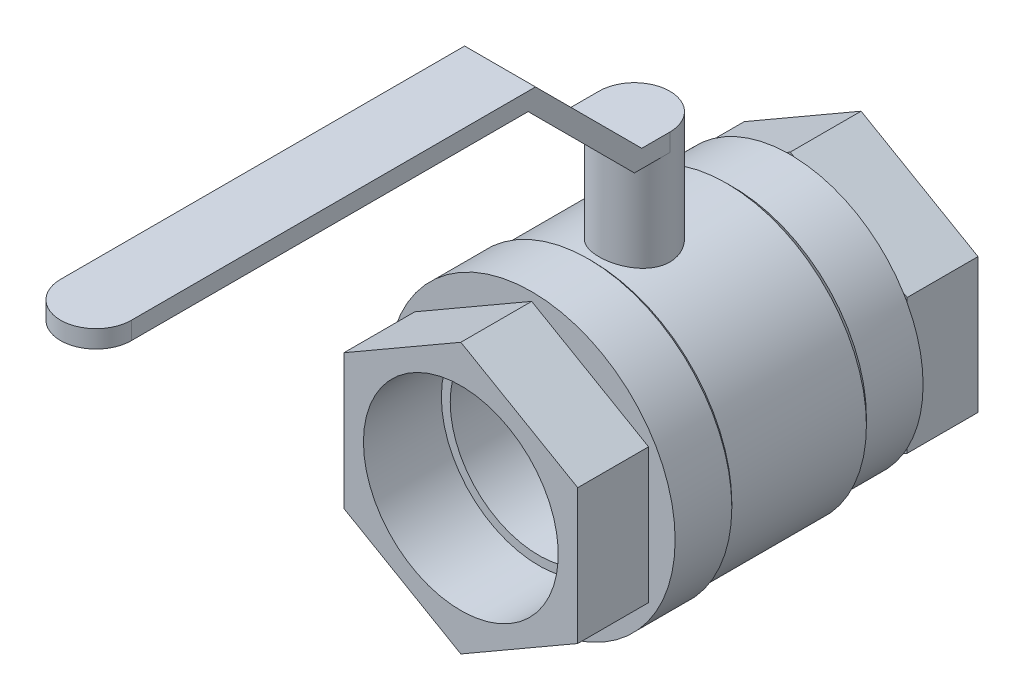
ISO-10303-21;
HEADER;
FILE_DESCRIPTION(('STEP AP214'),'2;1');
FILE_NAME('part.step','',(''),(''),'','','');
FILE_SCHEMA(('AUTOMOTIVE_DESIGN { 1 0 10303 214 1 1 1 1 }'));
ENDSEC;
DATA;
#1=APPLICATION_CONTEXT('core data for automotive mechanical design processes');
#2=APPLICATION_PROTOCOL_DEFINITION('international standard','automotive_design',2000,#1);
#3=PRODUCT_CONTEXT('',#1,'mechanical');
#4=PRODUCT('Part','Part','',(#3));
#5=PRODUCT_RELATED_PRODUCT_CATEGORY('part','',(#4));
#6=PRODUCT_DEFINITION_FORMATION('','',#4);
#7=PRODUCT_DEFINITION_CONTEXT('part definition',#1,'design');
#8=PRODUCT_DEFINITION('design','',#6,#7);
#9=PRODUCT_DEFINITION_SHAPE('','',#8);
#10=(LENGTH_UNIT() NAMED_UNIT(*) SI_UNIT(.MILLI.,.METRE.));
#11=(NAMED_UNIT(*) PLANE_ANGLE_UNIT() SI_UNIT($,.RADIAN.));
#12=(NAMED_UNIT(*) SI_UNIT($,.STERADIAN.) SOLID_ANGLE_UNIT());
#13=UNCERTAINTY_MEASURE_WITH_UNIT(LENGTH_MEASURE(1.E-05),#10,'distance_accuracy_value','');
#14=(GEOMETRIC_REPRESENTATION_CONTEXT(3) GLOBAL_UNCERTAINTY_ASSIGNED_CONTEXT((#13)) GLOBAL_UNIT_ASSIGNED_CONTEXT((#10,
#11,#12)) REPRESENTATION_CONTEXT('',''));
#15=CARTESIAN_POINT('',(0.,0.,0.));
#16=DIRECTION('',(0.,0.,1.));
#17=DIRECTION('',(1.,0.,0.));
#18=AXIS2_PLACEMENT_3D('',#15,#16,#17);
#19=CARTESIAN_POINT('',(0.,70.,-49.));
#20=DIRECTION('',(0.,1.,0.));
#21=DIRECTION('',(0.,0.,1.));
#22=AXIS2_PLACEMENT_3D('',#19,#20,#21);
#23=PLANE('',#22);
#24=CARTESIAN_POINT('',(0.,70.,-49.));
#25=DIRECTION('',(0.,1.,0.));
#26=DIRECTION('',(0.,0.,1.));
#27=AXIS2_PLACEMENT_3D('',#24,#25,#26);
#28=CIRCLE('',#27,10.);
#29=CARTESIAN_POINT('',(10.,70.,-49.));
#30=VERTEX_POINT('',#29);
#31=CARTESIAN_POINT('',(-10.,70.,-49.));
#32=VERTEX_POINT('',#31);
#33=EDGE_CURVE('E278',#30,#32,#28,.T.);
#34=ORIENTED_EDGE('',*,*,#33,.T.);
#35=DIRECTION('',(0.,0.,1.));
#36=VECTOR('',#35,1.);
#37=CARTESIAN_POINT('',(-10.,70.,-49.));
#38=LINE('',#37,#36);
#39=CARTESIAN_POINT('',(-10.,70.,-41.0710678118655));
#40=VERTEX_POINT('',#39);
#41=EDGE_CURVE('E240',#32,#40,#38,.T.);
#42=ORIENTED_EDGE('',*,*,#41,.T.);
#43=DIRECTION('',(1.,0.,0.));
#44=VECTOR('',#43,1.);
#45=CARTESIAN_POINT('',(0.,70.,-41.0710678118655));
#46=LINE('',#45,#44);
#47=CARTESIAN_POINT('',(10.,70.,-41.0710678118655));
#48=VERTEX_POINT('',#47);
#49=EDGE_CURVE('E422',#40,#48,#46,.T.);
#50=ORIENTED_EDGE('',*,*,#49,.T.);
#51=DIRECTION('',(0.,0.,1.));
#52=VECTOR('',#51,1.);
#53=CARTESIAN_POINT('',(10.,70.,-49.));
#54=LINE('',#53,#52);
#55=EDGE_CURVE('E252',#30,#48,#54,.T.);
#56=ORIENTED_EDGE('',*,*,#55,.F.);
#57=EDGE_LOOP('',(#34,#42,#50,#56));
#58=FACE_BOUND('',#57,.T.);
#59=ADVANCED_FACE('F38',(#58),#23,.T.);
#60=CARTESIAN_POINT('',(0.,0.,-108.));
#61=DIRECTION('',(0.,0.,-1.));
#62=DIRECTION('',(-1.,0.,0.));
#63=AXIS2_PLACEMENT_3D('',#60,#61,#62);
#64=CYLINDRICAL_SURFACE('',#63,39.5);
#65=CARTESIAN_POINT('',(0.,0.,-37.));
#66=DIRECTION('',(0.,0.,-1.));
#67=DIRECTION('',(-1.,0.,0.));
#68=AXIS2_PLACEMENT_3D('',#65,#66,#67);
#69=CIRCLE('',#68,39.5);
#70=CARTESIAN_POINT('',(-39.5,0.,-37.));
#71=VERTEX_POINT('',#70);
#72=EDGE_CURVE('E405',#71,#71,#69,.T.);
#73=ORIENTED_EDGE('',*,*,#72,.T.);
#74=EDGE_LOOP('',(#73));
#75=FACE_BOUND('',#74,.T.);
#76=CARTESIAN_POINT('',(0.,0.,-75.));
#77=DIRECTION('',(0.,0.,-1.));
#78=DIRECTION('',(-1.,0.,0.));
#79=AXIS2_PLACEMENT_3D('',#76,#77,#78);
#80=CIRCLE('',#79,39.5);
#81=CARTESIAN_POINT('',(-39.5,0.,-75.));
#82=VERTEX_POINT('',#81);
#83=EDGE_CURVE('E402',#82,#82,#80,.T.);
#84=ORIENTED_EDGE('',*,*,#83,.F.);
#85=EDGE_LOOP('',(#84));
#86=FACE_BOUND('',#85,.T.);
#87=CARTESIAN_POINT('',(0.,39.5,-59.));
#88=CARTESIAN_POINT('',(-0.276161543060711,39.4999993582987,-58.9999988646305));
#89=CARTESIAN_POINT('',(-0.552345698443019,39.4970966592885,-58.9885505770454));
#90=CARTESIAN_POINT('',(-1.10271739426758,39.4855645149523,-58.9428509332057));
#91=CARTESIAN_POINT('',(-1.37690471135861,39.4769344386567,-58.9085970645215));
#92=CARTESIAN_POINT('',(-1.9214138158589,39.4541817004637,-58.8175554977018));
#93=CARTESIAN_POINT('',(-2.19173372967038,39.4400564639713,-58.7607572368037));
#94=CARTESIAN_POINT('',(-2.7264592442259,39.4067023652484,-58.6250978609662));
#95=CARTESIAN_POINT('',(-2.99086470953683,39.3874733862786,-58.5462362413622));
#96=CARTESIAN_POINT('',(-3.51159747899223,39.3444641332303,-58.3671977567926));
#97=CARTESIAN_POINT('',(-3.76793451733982,39.3206896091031,-58.2670478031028));
#98=CARTESIAN_POINT('',(-4.27115825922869,39.2692142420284,-58.0461438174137));
#99=CARTESIAN_POINT('',(-4.51804491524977,39.2415133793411,-57.925389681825));
#100=CARTESIAN_POINT('',(-5.00071632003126,39.1829291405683,-57.6641863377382));
#101=CARTESIAN_POINT('',(-5.23650290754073,39.1520462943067,-57.5237404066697));
#102=CARTESIAN_POINT('',(-5.69559904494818,39.0878996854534,-57.2240698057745));
#103=CARTESIAN_POINT('',(-5.91890408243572,39.0546350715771,-57.064838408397));
#104=CARTESIAN_POINT('',(-6.35555981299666,38.9859796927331,-56.725587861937));
#105=CARTESIAN_POINT('',(-6.56864935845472,38.9505609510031,-56.545238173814));
#106=CARTESIAN_POINT('',(-6.97905330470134,38.8791233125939,-56.1673330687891));
#107=CARTESIAN_POINT('',(-7.17636046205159,38.8431041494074,-55.9697698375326));
#108=CARTESIAN_POINT('',(-7.55382669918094,38.7714665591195,-55.558777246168));
#109=CARTESIAN_POINT('',(-7.73398376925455,38.7358481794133,-55.345346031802));
#110=CARTESIAN_POINT('',(-8.07584116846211,38.6660215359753,-54.9041207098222));
#111=CARTESIAN_POINT('',(-8.23754978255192,38.6318126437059,-54.6763331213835));
#112=CARTESIAN_POINT('',(-8.5438819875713,38.5652310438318,-54.2040881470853));
#113=CARTESIAN_POINT('',(-8.68819623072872,38.5328957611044,-53.9594246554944));
#114=CARTESIAN_POINT('',(-8.95559180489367,38.471628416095,-53.4584702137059));
#115=CARTESIAN_POINT('',(-9.0786814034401,38.4426950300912,-53.2021838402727));
#116=CARTESIAN_POINT('',(-9.30273773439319,38.3890915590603,-52.6796579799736));
#117=CARTESIAN_POINT('',(-9.4037028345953,38.364421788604,-52.4134177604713));
#118=CARTESIAN_POINT('',(-9.58266025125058,38.3201139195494,-51.8729179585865));
#119=CARTESIAN_POINT('',(-9.66065313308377,38.3004756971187,-51.5986585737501));
#120=CARTESIAN_POINT('',(-9.79163453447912,38.267197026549,-51.049839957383));
#121=CARTESIAN_POINT('',(-9.84510298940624,38.2534418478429,-50.7754021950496));
#122=CARTESIAN_POINT('',(-9.92889175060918,38.23177980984,-50.222785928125));
#123=CARTESIAN_POINT('',(-9.95921234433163,38.2238728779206,-49.9446074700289));
#124=CARTESIAN_POINT('',(-9.9964341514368,38.2141554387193,-49.3866223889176));
#125=CARTESIAN_POINT('',(-10.0033387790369,38.2123440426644,-49.1068160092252));
#126=CARTESIAN_POINT('',(-9.99367596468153,38.2148723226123,-48.5476390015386));
#127=CARTESIAN_POINT('',(-9.97710885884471,38.219211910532,-48.2682683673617));
#128=CARTESIAN_POINT('',(-9.9213574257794,38.2337215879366,-47.7190001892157));
#129=CARTESIAN_POINT('',(-9.8827475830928,38.2437435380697,-47.4490401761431));
#130=CARTESIAN_POINT('',(-9.78367934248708,38.2692073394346,-46.9134260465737));
#131=CARTESIAN_POINT('',(-9.72322136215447,38.2846490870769,-46.6477718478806));
#132=CARTESIAN_POINT('',(-9.58095648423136,38.3204990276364,-46.1226280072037));
#133=CARTESIAN_POINT('',(-9.49915235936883,38.3409065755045,-45.8631375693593));
#134=CARTESIAN_POINT('',(-9.31479498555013,38.3861120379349,-45.3519243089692));
#135=CARTESIAN_POINT('',(-9.21223395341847,38.4109115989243,-45.1002044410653));
#136=CARTESIAN_POINT('',(-8.9860075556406,38.4644681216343,-44.6037716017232));
#137=CARTESIAN_POINT('',(-8.86213958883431,38.4932625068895,-44.3591550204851));
#138=CARTESIAN_POINT('',(-8.59492055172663,38.5538078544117,-43.8811804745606));
#139=CARTESIAN_POINT('',(-8.45156859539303,38.5855589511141,-43.647823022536));
#140=CARTESIAN_POINT('',(-8.14635192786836,38.6511488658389,-43.1938153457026));
#141=CARTESIAN_POINT('',(-7.9844848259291,38.6849879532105,-42.9731667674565));
#142=CARTESIAN_POINT('',(-7.64331925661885,38.753837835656,-42.5459783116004));
#143=CARTESIAN_POINT('',(-7.46402046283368,38.788848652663,-42.3394386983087));
#144=CARTESIAN_POINT('',(-7.08363556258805,38.860141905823,-41.9359203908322));
#145=CARTESIAN_POINT('',(-6.88206481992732,38.8964315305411,-41.7393995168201));
#146=CARTESIAN_POINT('',(-6.46300680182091,38.9682527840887,-41.3639880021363));
#147=CARTESIAN_POINT('',(-6.24551978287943,39.0037844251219,-41.185097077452));
#148=CARTESIAN_POINT('',(-5.79599899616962,39.0731124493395,-40.8461263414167));
#149=CARTESIAN_POINT('',(-5.56396160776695,39.1069083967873,-40.6860512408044));
#150=CARTESIAN_POINT('',(-5.08702096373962,39.1718024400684,-40.385966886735));
#151=CARTESIAN_POINT('',(-4.84212273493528,39.2029015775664,-40.2459498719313));
#152=CARTESIAN_POINT('',(-4.34007233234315,39.261659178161,-39.9864589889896));
#153=CARTESIAN_POINT('',(-4.08287691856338,39.2893040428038,-39.8670656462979));
#154=CARTESIAN_POINT('',(-3.55889875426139,39.3402277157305,-39.6504219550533));
#155=CARTESIAN_POINT('',(-3.29211594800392,39.3635064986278,-39.5531717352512));
#156=CARTESIAN_POINT('',(-2.7509280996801,39.405025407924,-39.3816343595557));
#157=CARTESIAN_POINT('',(-2.47652428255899,39.4232663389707,-39.3073435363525));
#158=CARTESIAN_POINT('',(-1.92208982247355,39.4541841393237,-39.1823465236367));
#159=CARTESIAN_POINT('',(-1.64205932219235,39.4668611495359,-39.1316397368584));
#160=CARTESIAN_POINT('',(-1.08588647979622,39.4860258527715,-39.0552745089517));
#161=CARTESIAN_POINT('',(-0.809834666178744,39.4926670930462,-39.0289942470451));
#162=CARTESIAN_POINT('',(-0.256425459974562,39.5001369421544,-38.9994487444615));
#163=CARTESIAN_POINT('',(0.0209319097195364,39.5009656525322,-38.9961831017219));
#164=CARTESIAN_POINT('',(0.574890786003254,39.4967874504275,-39.0126939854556));
#165=CARTESIAN_POINT('',(0.851492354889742,39.4917810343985,-39.0324685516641));
#166=CARTESIAN_POINT('',(1.4019378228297,39.4760735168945,-39.0948856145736));
#167=CARTESIAN_POINT('',(1.67578173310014,39.4653724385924,-39.1375280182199));
#168=CARTESIAN_POINT('',(2.2145776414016,39.4387790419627,-39.244492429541));
#169=CARTESIAN_POINT('',(2.47960157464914,39.422968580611,-39.3084730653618));
#170=CARTESIAN_POINT('',(3.00323400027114,39.3865391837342,-39.4577411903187));
#171=CARTESIAN_POINT('',(3.26184257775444,39.3659203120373,-39.5430283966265));
#172=CARTESIAN_POINT('',(3.77089144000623,39.3204231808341,-39.7342407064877));
#173=CARTESIAN_POINT('',(4.02133256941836,39.2955453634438,-39.8401636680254));
#174=CARTESIAN_POINT('',(4.51253964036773,39.2421718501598,-40.0719114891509));
#175=CARTESIAN_POINT('',(4.75330191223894,39.2136747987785,-40.1977438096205));
#176=CARTESIAN_POINT('',(5.22774004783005,39.1532749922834,-40.4708158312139));
#177=CARTESIAN_POINT('',(5.46121206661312,39.1213204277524,-40.6183982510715));
#178=CARTESIAN_POINT('',(5.91496355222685,39.0552913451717,-40.9322057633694));
#179=CARTESIAN_POINT('',(6.13524244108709,39.0212167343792,-41.0984316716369));
#180=CARTESIAN_POINT('',(6.56123429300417,38.9518521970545,-41.4484301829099));
#181=CARTESIAN_POINT('',(6.76694523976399,38.9165621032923,-41.6322052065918));
#182=CARTESIAN_POINT('',(7.16246769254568,38.8457131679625,-42.0160891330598));
#183=CARTESIAN_POINT('',(7.35227898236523,38.8101543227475,-42.2161982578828));
#184=CARTESIAN_POINT('',(7.71936922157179,38.7388330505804,-42.636731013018));
#185=CARTESIAN_POINT('',(7.89621013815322,38.7030881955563,-42.8575402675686));
#186=CARTESIAN_POINT('',(8.2306672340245,38.6333445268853,-43.3135195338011));
#187=CARTESIAN_POINT('',(8.38828390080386,38.599345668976,-43.5486891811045));
#188=CARTESIAN_POINT('',(8.68319270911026,38.5340756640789,-44.0318729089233));
#189=CARTESIAN_POINT('',(8.82048091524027,38.5028050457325,-44.2798894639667));
#190=CARTESIAN_POINT('',(9.07360709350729,38.4439402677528,-44.7869356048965));
#191=CARTESIAN_POINT('',(9.18945366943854,38.4163446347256,-45.0459607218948));
#192=CARTESIAN_POINT('',(9.39823540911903,38.3658005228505,-45.5717755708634));
#193=CARTESIAN_POINT('',(9.49129952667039,38.3428260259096,-45.8385115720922));
#194=CARTESIAN_POINT('',(9.65461226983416,38.3020306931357,-46.3792690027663));
#195=CARTESIAN_POINT('',(9.72486092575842,38.2842098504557,-46.6532904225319));
#196=CARTESIAN_POINT('',(9.84192413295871,38.2542832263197,-47.2065498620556));
#197=CARTESIAN_POINT('',(9.88874311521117,38.2421763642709,-47.4857868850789));
#198=CARTESIAN_POINT('',(9.95854696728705,38.2240585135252,-48.0474183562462));
#199=CARTESIAN_POINT('',(9.98153242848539,38.2180473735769,-48.3298127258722));
#200=CARTESIAN_POINT('',(10.0031383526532,38.2123977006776,-48.8872420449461));
#201=CARTESIAN_POINT('',(10.002457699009,38.212576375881,-49.1622482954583));
#202=CARTESIAN_POINT('',(9.97846043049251,38.2188498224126,-49.7111993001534));
#203=CARTESIAN_POINT('',(9.95514428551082,38.224944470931,-49.985144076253));
#204=CARTESIAN_POINT('',(9.88607794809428,38.2428650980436,-50.5299901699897));
#205=CARTESIAN_POINT('',(9.84032837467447,38.254690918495,-50.800891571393));
#206=CARTESIAN_POINT('',(9.7267803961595,38.2837194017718,-51.3377379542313));
#207=CARTESIAN_POINT('',(9.658981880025,38.3009220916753,-51.6036829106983));
#208=CARTESIAN_POINT('',(9.50239822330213,38.3400689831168,-52.1270688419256));
#209=CARTESIAN_POINT('',(9.41375195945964,38.3619817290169,-52.3845537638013));
#210=CARTESIAN_POINT('',(9.21588821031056,38.4099956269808,-52.8911941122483));
#211=CARTESIAN_POINT('',(9.10666329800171,38.4360982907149,-53.1403464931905));
#212=CARTESIAN_POINT('',(8.86847587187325,38.4917534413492,-53.6285971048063));
#213=CARTESIAN_POINT('',(8.73951510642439,38.5213056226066,-53.8676962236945));
#214=CARTESIAN_POINT('',(8.46274480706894,38.5830538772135,-54.3343748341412));
#215=CARTESIAN_POINT('',(8.31493435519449,38.6152500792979,-54.5619537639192));
#216=CARTESIAN_POINT('',(7.99726359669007,38.6823062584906,-55.0100923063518));
#217=CARTESIAN_POINT('',(7.8269198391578,38.7172144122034,-55.2303021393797));
#218=CARTESIAN_POINT('',(7.46855354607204,38.7879369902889,-55.6556783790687));
#219=CARTESIAN_POINT('',(7.28053072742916,38.8237514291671,-55.8608445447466));
#220=CARTESIAN_POINT('',(6.88799150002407,38.8953130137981,-56.2548551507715));
#221=CARTESIAN_POINT('',(6.68347111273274,38.9310601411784,-56.4436956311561));
#222=CARTESIAN_POINT('',(6.25930183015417,39.0015044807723,-56.8037509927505));
#223=CARTESIAN_POINT('',(6.03965325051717,39.0362017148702,-56.9749662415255));
#224=CARTESIAN_POINT('',(5.5823391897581,39.10424434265,-57.3016832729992));
#225=CARTESIAN_POINT('',(5.34441114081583,39.1375516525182,-57.4568257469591));
#226=CARTESIAN_POINT('',(4.85600767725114,39.2011454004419,-57.7464139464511));
#227=CARTESIAN_POINT('',(4.60553690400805,39.2314329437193,-57.8808672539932));
#228=CARTESIAN_POINT('',(4.09380764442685,39.2881277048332,-58.1280584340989));
#229=CARTESIAN_POINT('',(3.832553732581,39.3145365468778,-58.2408054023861));
#230=CARTESIAN_POINT('',(3.301033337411,39.3627278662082,-58.4437319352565));
#231=CARTESIAN_POINT('',(3.03076819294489,39.3845110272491,-58.5339148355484));
#232=CARTESIAN_POINT('',(2.53356245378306,39.4193007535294,-58.676523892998));
#233=CARTESIAN_POINT('',(2.30779068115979,39.4331845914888,-58.7328432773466));
#234=CARTESIAN_POINT('',(1.85268265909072,39.4571852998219,-58.8296325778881));
#235=CARTESIAN_POINT('',(1.62334665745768,39.4673024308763,-58.8701035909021));
#236=CARTESIAN_POINT('',(1.16224813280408,39.4835712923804,-58.9349579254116));
#237=CARTESIAN_POINT('',(0.930485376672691,39.4897226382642,-58.9593396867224));
#238=CARTESIAN_POINT('',(0.465820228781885,39.4979367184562,-58.9918590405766));
#239=CARTESIAN_POINT('',(0.232918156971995,39.5000005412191,-59.0000009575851));
#240=CARTESIAN_POINT('',(0.,39.5,-59.));
#241=B_SPLINE_CURVE_WITH_KNOTS('',3,(#87,#88,#89,#90,#91,#92,#93,#94,#95,#96,#97,#98,#99,#100,
#101,#102,#103,#104,#105,#106,#107,#108,#109,#110,#111,#112,#113,#114,#115,#116,#117,#118,#119,
#120,#121,#122,#123,#124,#125,#126,#127,#128,#129,#130,#131,#132,#133,#134,#135,#136,#137,#138,
#139,#140,#141,#142,#143,#144,#145,#146,#147,#148,#149,#150,#151,#152,#153,#154,#155,#156,#157,
#158,#159,#160,#161,#162,#163,#164,#165,#166,#167,#168,#169,#170,#171,#172,#173,#174,#175,#176,
#177,#178,#179,#180,#181,#182,#183,#184,#185,#186,#187,#188,#189,#190,#191,#192,#193,#194,#195,
#196,#197,#198,#199,#200,#201,#202,#203,#204,#205,#206,#207,#208,#209,#210,#211,#212,#213,#214,
#215,#216,#217,#218,#219,#220,#221,#222,#223,#224,#225,#226,#227,#228,#229,#230,#231,#232,#233,
#234,#235,#236,#237,#238,#239,#240),.UNSPECIFIED.,.T.,.F.,(4,2,2,2,2,2,2,2,2,2,2,2,2,2,2,2,2,2,
2,2,2,2,2,2,2,2,2,2,2,2,2,2,2,2,2,2,2,2,2,2,2,2,2,2,2,2,2,2,2,2,2,2,2,2,2,2,2,2,2,2,2,2,2,2,2,2,
2,2,2,2,2,2,2,2,2,2,4),(0.,0.828272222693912,1.65663570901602,2.4853877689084,3.31415878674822,
4.14188829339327,4.96962196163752,5.79721802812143,6.62511138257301,7.46834648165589,
8.31196639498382,9.15568504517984,9.99902328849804,10.8556496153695,11.7119415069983,
12.5682965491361,13.4246305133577,14.2634048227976,15.1021687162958,15.9408103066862,
16.7794398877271,17.5971502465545,18.4148449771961,19.2324335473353,20.0503292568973,
20.8764818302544,21.702671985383,22.528968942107,23.3552813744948,24.205818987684,
25.0563428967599,25.9070792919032,26.7574856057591,27.611140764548,28.4648008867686,
29.3183245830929,30.1718266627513,31.0029532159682,31.8340652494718,32.6651065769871,
33.4961445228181,34.3144787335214,35.1328020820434,35.9510405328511,36.7695863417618,
37.6027765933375,38.4360033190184,39.269345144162,40.1026982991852,40.9571152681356,
41.8115105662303,42.666071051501,43.5202878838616,44.3695516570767,45.2188143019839,
46.0679162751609,46.9169971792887,47.7410258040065,48.5650373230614,49.3890261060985,
50.2130190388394,51.0316711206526,51.8506192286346,52.6694948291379,53.4884103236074,
54.32919620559,55.1699955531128,56.0109982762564,56.8519834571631,57.7089073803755,
58.5655165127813,59.4217659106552,60.2778886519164,60.9766306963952,61.6753243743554,
62.3740857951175,63.0726611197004),.UNSPECIFIED.);
#242=CARTESIAN_POINT('',(0.,39.5,-59.));
#243=VERTEX_POINT('',#242);
#244=EDGE_CURVE('E414',#243,#243,#241,.T.);
#245=ORIENTED_EDGE('',*,*,#244,.F.);
#246=EDGE_LOOP('',(#245));
#247=FACE_BOUND('',#246,.T.);
#248=ADVANCED_FACE('F423',(#75,#86,#247),#64,.T.);
#249=CARTESIAN_POINT('',(37.5,0.,-93.));
#250=DIRECTION('',(0.,0.,-1.));
#251=DIRECTION('',(-1.,0.,0.));
#252=AXIS2_PLACEMENT_3D('',#249,#250,#251);
#253=PLANE('',#252);
#254=DIRECTION('',(0.866025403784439,0.5,0.));
#255=VECTOR('',#254,1.);
#256=CARTESIAN_POINT('',(33.,-19.0525588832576,-93.));
#257=LINE('',#256,#255);
#258=CARTESIAN_POINT('',(0.,-38.1051177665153,-93.));
#259=VERTEX_POINT('',#258);
#260=CARTESIAN_POINT('',(1.07477714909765,-37.4845948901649,-93.));
#261=VERTEX_POINT('',#260);
#262=EDGE_CURVE('E338',#259,#261,#257,.T.);
#263=ORIENTED_EDGE('',*,*,#262,.T.);
#264=CARTESIAN_POINT('',(0.,0.,-93.));
#265=DIRECTION('',(0.,0.,-1.));
#266=DIRECTION('',(-1.,0.,0.));
#267=AXIS2_PLACEMENT_3D('',#264,#265,#266);
#268=CIRCLE('',#267,37.5);
#269=CARTESIAN_POINT('',(-1.07477714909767,-37.4845948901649,-93.));
#270=VERTEX_POINT('',#269);
#271=EDGE_CURVE('E934',#261,#270,#268,.T.);
#272=ORIENTED_EDGE('',*,*,#271,.T.);
#273=DIRECTION('',(0.866025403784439,-0.5,0.));
#274=VECTOR('',#273,1.);
#275=CARTESIAN_POINT('',(0.,-38.1051177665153,-93.));
#276=LINE('',#275,#274);
#277=EDGE_CURVE('E287',#270,#259,#276,.T.);
#278=ORIENTED_EDGE('',*,*,#277,.T.);
#279=EDGE_LOOP('',(#263,#272,#278));
#280=FACE_BOUND('',#279,.T.);
#281=ADVANCED_FACE('F493',(#280),#253,.F.);
#282=CARTESIAN_POINT('',(-33.,-19.0525588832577,-93.));
#283=VERTEX_POINT('',#282);
#284=CARTESIAN_POINT('',(-31.9252228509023,-19.6730817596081,-93.));
#285=VERTEX_POINT('',#284);
#286=EDGE_CURVE('E282',#283,#285,#276,.T.);
#287=ORIENTED_EDGE('',*,*,#286,.T.);
#288=CARTESIAN_POINT('',(-33.,-17.8115131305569,-93.));
#289=VERTEX_POINT('',#288);
#290=EDGE_CURVE('E384',#285,#289,#268,.T.);
#291=ORIENTED_EDGE('',*,*,#290,.T.);
#292=DIRECTION('',(0.,-1.,0.));
#293=VECTOR('',#292,1.);
#294=CARTESIAN_POINT('',(-33.,-19.0525588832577,-93.));
#295=LINE('',#294,#293);
#296=EDGE_CURVE('E292',#289,#283,#295,.T.);
#297=ORIENTED_EDGE('',*,*,#296,.T.);
#298=EDGE_LOOP('',(#287,#291,#297));
#299=FACE_BOUND('',#298,.T.);
#300=ADVANCED_FACE('F496',(#299),#253,.F.);
#301=CARTESIAN_POINT('',(-33.,19.0525588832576,-93.));
#302=VERTEX_POINT('',#301);
#303=CARTESIAN_POINT('',(-33.,17.8115131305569,-93.));
#304=VERTEX_POINT('',#303);
#305=EDGE_CURVE('E288',#302,#304,#295,.T.);
#306=ORIENTED_EDGE('',*,*,#305,.T.);
#307=CARTESIAN_POINT('',(-31.9252228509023,19.673081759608,-93.));
#308=VERTEX_POINT('',#307);
#309=EDGE_CURVE('E395',#304,#308,#268,.T.);
#310=ORIENTED_EDGE('',*,*,#309,.T.);
#311=DIRECTION('',(-0.866025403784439,-0.5,0.));
#312=VECTOR('',#311,1.);
#313=CARTESIAN_POINT('',(-33.,19.0525588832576,-93.));
#314=LINE('',#313,#312);
#315=EDGE_CURVE('E297',#308,#302,#314,.T.);
#316=ORIENTED_EDGE('',*,*,#315,.T.);
#317=EDGE_LOOP('',(#306,#310,#316));
#318=FACE_BOUND('',#317,.T.);
#319=ADVANCED_FACE('F773',(#318),#253,.F.);
#320=CARTESIAN_POINT('',(0.,38.1051177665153,-93.));
#321=VERTEX_POINT('',#320);
#322=CARTESIAN_POINT('',(-1.07477714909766,37.4845948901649,-93.));
#323=VERTEX_POINT('',#322);
#324=EDGE_CURVE('E293',#321,#323,#314,.T.);
#325=ORIENTED_EDGE('',*,*,#324,.T.);
#326=CARTESIAN_POINT('',(1.07477714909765,37.4845948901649,-93.));
#327=VERTEX_POINT('',#326);
#328=EDGE_CURVE('E399',#323,#327,#268,.T.);
#329=ORIENTED_EDGE('',*,*,#328,.T.);
#330=DIRECTION('',(-0.866025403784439,0.5,0.));
#331=VECTOR('',#330,1.);
#332=CARTESIAN_POINT('',(0.,38.1051177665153,-93.));
#333=LINE('',#332,#331);
#334=EDGE_CURVE('E302',#327,#321,#333,.T.);
#335=ORIENTED_EDGE('',*,*,#334,.T.);
#336=EDGE_LOOP('',(#325,#329,#335));
#337=FACE_BOUND('',#336,.T.);
#338=ADVANCED_FACE('F780',(#337),#253,.F.);
#339=CARTESIAN_POINT('',(33.,19.0525588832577,-93.));
#340=VERTEX_POINT('',#339);
#341=CARTESIAN_POINT('',(31.9252228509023,19.673081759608,-93.));
#342=VERTEX_POINT('',#341);
#343=EDGE_CURVE('E298',#340,#342,#333,.T.);
#344=ORIENTED_EDGE('',*,*,#343,.T.);
#345=CARTESIAN_POINT('',(33.,17.8115131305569,-93.));
#346=VERTEX_POINT('',#345);
#347=EDGE_CURVE('E946',#342,#346,#268,.T.);
#348=ORIENTED_EDGE('',*,*,#347,.T.);
#349=DIRECTION('',(0.,1.,0.));
#350=VECTOR('',#349,1.);
#351=CARTESIAN_POINT('',(33.,19.0525588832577,-93.));
#352=LINE('',#351,#350);
#353=EDGE_CURVE('E306',#346,#340,#352,.T.);
#354=ORIENTED_EDGE('',*,*,#353,.T.);
#355=EDGE_LOOP('',(#344,#348,#354));
#356=FACE_BOUND('',#355,.T.);
#357=ADVANCED_FACE('F787',(#356),#253,.F.);
#358=CARTESIAN_POINT('',(31.9252228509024,-19.673081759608,-93.));
#359=VERTEX_POINT('',#358);
#360=CARTESIAN_POINT('',(33.,-19.0525588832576,-93.));
#361=VERTEX_POINT('',#360);
#362=EDGE_CURVE('E327',#359,#361,#257,.T.);
#363=ORIENTED_EDGE('',*,*,#362,.T.);
#364=CARTESIAN_POINT('',(33.,-17.8115131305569,-93.));
#365=VERTEX_POINT('',#364);
#366=EDGE_CURVE('E303',#361,#365,#352,.T.);
#367=ORIENTED_EDGE('',*,*,#366,.T.);
#368=EDGE_CURVE('E922',#365,#359,#268,.T.);
#369=ORIENTED_EDGE('',*,*,#368,.T.);
#370=EDGE_LOOP('',(#363,#367,#369));
#371=FACE_BOUND('',#370,.T.);
#372=ADVANCED_FACE('F498',(#371),#253,.F.);
#373=CARTESIAN_POINT('',(40.,0.,-20.));
#374=DIRECTION('',(0.,0.,-1.));
#375=DIRECTION('',(-1.,0.,0.));
#376=AXIS2_PLACEMENT_3D('',#373,#374,#375);
#377=PLANE('',#376);
#378=CARTESIAN_POINT('',(0.,0.,-20.));
#379=DIRECTION('',(0.,0.,-1.));
#380=DIRECTION('',(-1.,0.,0.));
#381=AXIS2_PLACEMENT_3D('',#378,#379,#380);
#382=CIRCLE('',#381,40.5);
#383=CARTESIAN_POINT('',(-40.5,0.,-20.));
#384=VERTEX_POINT('',#383);
#385=EDGE_CURVE('E411',#384,#384,#382,.T.);
#386=ORIENTED_EDGE('',*,*,#385,.F.);
#387=EDGE_LOOP('',(#386));
#388=FACE_BOUND('',#387,.T.);
#389=DIRECTION('',(0.866025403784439,-0.5,0.));
#390=VECTOR('',#389,1.);
#391=CARTESIAN_POINT('',(-33.,-19.0525588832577,-20.));
#392=LINE('',#391,#390);
#393=CARTESIAN_POINT('',(-33.,-19.0525588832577,-20.));
#394=VERTEX_POINT('',#393);
#395=CARTESIAN_POINT('',(0.,-38.1051177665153,-20.));
#396=VERTEX_POINT('',#395);
#397=EDGE_CURVE('E361',#394,#396,#392,.T.);
#398=ORIENTED_EDGE('',*,*,#397,.F.);
#399=DIRECTION('',(0.,-1.,0.));
#400=VECTOR('',#399,1.);
#401=CARTESIAN_POINT('',(-33.,19.0525588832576,-20.));
#402=LINE('',#401,#400);
#403=CARTESIAN_POINT('',(-33.,19.0525588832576,-20.));
#404=VERTEX_POINT('',#403);
#405=EDGE_CURVE('E358',#404,#394,#402,.T.);
#406=ORIENTED_EDGE('',*,*,#405,.F.);
#407=DIRECTION('',(-0.866025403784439,-0.5,0.));
#408=VECTOR('',#407,1.);
#409=CARTESIAN_POINT('',(0.,38.1051177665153,-20.));
#410=LINE('',#409,#408);
#411=CARTESIAN_POINT('',(0.,38.1051177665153,-20.));
#412=VERTEX_POINT('',#411);
#413=EDGE_CURVE('E355',#412,#404,#410,.T.);
#414=ORIENTED_EDGE('',*,*,#413,.F.);
#415=DIRECTION('',(-0.866025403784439,0.5,0.));
#416=VECTOR('',#415,1.);
#417=CARTESIAN_POINT('',(33.,19.0525588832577,-20.));
#418=LINE('',#417,#416);
#419=CARTESIAN_POINT('',(33.,19.0525588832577,-20.));
#420=VERTEX_POINT('',#419);
#421=EDGE_CURVE('E352',#420,#412,#418,.T.);
#422=ORIENTED_EDGE('',*,*,#421,.F.);
#423=DIRECTION('',(0.,1.,0.));
#424=VECTOR('',#423,1.);
#425=CARTESIAN_POINT('',(33.,-19.0525588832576,-20.));
#426=LINE('',#425,#424);
#427=CARTESIAN_POINT('',(33.,-19.0525588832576,-20.));
#428=VERTEX_POINT('',#427);
#429=EDGE_CURVE('E348',#428,#420,#426,.T.);
#430=ORIENTED_EDGE('',*,*,#429,.F.);
#431=DIRECTION('',(0.866025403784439,0.5,0.));
#432=VECTOR('',#431,1.);
#433=CARTESIAN_POINT('',(0.,-38.1051177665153,-20.));
#434=LINE('',#433,#432);
#435=EDGE_CURVE('E345',#396,#428,#434,.T.);
#436=ORIENTED_EDGE('',*,*,#435,.F.);
#437=EDGE_LOOP('',(#398,#406,#414,#422,#430,#436));
#438=FACE_BOUND('',#437,.T.);
#439=ADVANCED_FACE('F800',(#388,#438),#377,.F.);
#440=CARTESIAN_POINT('',(0.,0.,-108.));
#441=DIRECTION('',(0.,0.,-1.));
#442=DIRECTION('',(-1.,0.,0.));
#443=AXIS2_PLACEMENT_3D('',#440,#441,#442);
#444=CYLINDRICAL_SURFACE('',#443,40.5);
#445=CARTESIAN_POINT('',(0.,0.,-36.));
#446=DIRECTION('',(0.,0.,-1.));
#447=DIRECTION('',(-1.,0.,0.));
#448=AXIS2_PLACEMENT_3D('',#445,#446,#447);
#449=CIRCLE('',#448,40.5);
#450=CARTESIAN_POINT('',(-40.5,0.,-36.));
#451=VERTEX_POINT('',#450);
#452=EDGE_CURVE('E408',#451,#451,#449,.T.);
#453=ORIENTED_EDGE('',*,*,#452,.F.);
#454=EDGE_LOOP('',(#453));
#455=FACE_BOUND('',#454,.T.);
#456=ORIENTED_EDGE('',*,*,#385,.T.);
#457=EDGE_LOOP('',(#456));
#458=FACE_BOUND('',#457,.T.);
#459=ADVANCED_FACE('F508',(#455,#458),#444,.T.);
#460=CARTESIAN_POINT('',(0.,0.,-36.));
#461=DIRECTION('',(0.,0.,1.));
#462=DIRECTION('',(1.,0.,0.));
#463=AXIS2_PLACEMENT_3D('',#460,#461,#462);
#464=CONICAL_SURFACE('',#463,40.5,0.785398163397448);
#465=ORIENTED_EDGE('',*,*,#72,.F.);
#466=EDGE_LOOP('',(#465));
#467=FACE_BOUND('',#466,.T.);
#468=ORIENTED_EDGE('',*,*,#452,.T.);
#469=EDGE_LOOP('',(#468));
#470=FACE_BOUND('',#469,.T.);
#471=ADVANCED_FACE('F503',(#467,#470),#464,.T.);
#472=CARTESIAN_POINT('',(0.,0.,-75.));
#473=DIRECTION('',(0.,0.,1.));
#474=DIRECTION('',(1.,0.,0.));
#475=AXIS2_PLACEMENT_3D('',#472,#473,#474);
#476=CONICAL_SURFACE('',#475,39.5,0.785398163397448);
#477=CARTESIAN_POINT('',(0.,0.,-77.));
#478=DIRECTION('',(0.,0.,-1.));
#479=DIRECTION('',(-1.,0.,0.));
#480=AXIS2_PLACEMENT_3D('',#477,#478,#479);
#481=CIRCLE('',#480,37.5);
#482=CARTESIAN_POINT('',(-37.5,0.,-77.));
#483=VERTEX_POINT('',#482);
#484=EDGE_CURVE('E398',#483,#483,#481,.T.);
#485=ORIENTED_EDGE('',*,*,#484,.F.);
#486=EDGE_LOOP('',(#485));
#487=FACE_BOUND('',#486,.T.);
#488=ORIENTED_EDGE('',*,*,#83,.T.);
#489=EDGE_LOOP('',(#488));
#490=FACE_BOUND('',#489,.T.);
#491=ADVANCED_FACE('F500',(#487,#490),#476,.T.);
#492=CARTESIAN_POINT('',(0.,0.,-108.));
#493=DIRECTION('',(0.,0.,-1.));
#494=DIRECTION('',(-1.,0.,0.));
#495=AXIS2_PLACEMENT_3D('',#492,#493,#494);
#496=CYLINDRICAL_SURFACE('',#495,37.5);
#497=ORIENTED_EDGE('',*,*,#309,.F.);
#498=CARTESIAN_POINT('',(0.,0.,-93.));
#499=DIRECTION('',(0.,0.,-1.));
#500=DIRECTION('',(-1.,0.,0.));
#501=AXIS2_PLACEMENT_3D('',#498,#499,#500);
#502=CIRCLE('',#501,37.5);
#503=EDGE_CURVE('E285',#289,#304,#502,.T.);
#504=ORIENTED_EDGE('',*,*,#503,.F.);
#505=ORIENTED_EDGE('',*,*,#290,.F.);
#506=EDGE_CURVE('E343',#270,#285,#502,.T.);
#507=ORIENTED_EDGE('',*,*,#506,.F.);
#508=ORIENTED_EDGE('',*,*,#271,.F.);
#509=EDGE_CURVE('E927',#359,#261,#502,.T.);
#510=ORIENTED_EDGE('',*,*,#509,.F.);
#511=ORIENTED_EDGE('',*,*,#368,.F.);
#512=EDGE_CURVE('E935',#346,#365,#502,.T.);
#513=ORIENTED_EDGE('',*,*,#512,.F.);
#514=ORIENTED_EDGE('',*,*,#347,.F.);
#515=EDGE_CURVE('E936',#327,#342,#502,.T.);
#516=ORIENTED_EDGE('',*,*,#515,.F.);
#517=ORIENTED_EDGE('',*,*,#328,.F.);
#518=EDGE_CURVE('E344',#308,#323,#502,.T.);
#519=ORIENTED_EDGE('',*,*,#518,.F.);
#520=EDGE_LOOP('',(#497,#504,#505,#507,#508,#510,#511,#513,#514,#516,#517,#519));
#521=FACE_BOUND('',#520,.T.);
#522=ORIENTED_EDGE('',*,*,#484,.T.);
#523=EDGE_LOOP('',(#522));
#524=FACE_BOUND('',#523,.T.);
#525=ADVANCED_FACE('F488',(#521,#524),#496,.T.);
#526=CARTESIAN_POINT('',(0.,-38.1051177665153,-20.));
#527=DIRECTION('',(0.5,-0.866025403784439,0.));
#528=DIRECTION('',(0.866025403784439,0.5,0.));
#529=AXIS2_PLACEMENT_3D('',#526,#527,#528);
#530=PLANE('',#529);
#531=DIRECTION('',(0.866025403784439,0.5,0.));
#532=VECTOR('',#531,1.);
#533=CARTESIAN_POINT('',(0.,-38.1051177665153,0.));
#534=LINE('',#533,#532);
#535=CARTESIAN_POINT('',(0.,-38.1051177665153,0.));
#536=VERTEX_POINT('',#535);
#537=CARTESIAN_POINT('',(33.,-19.0525588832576,0.));
#538=VERTEX_POINT('',#537);
#539=EDGE_CURVE('E365',#536,#538,#534,.T.);
#540=ORIENTED_EDGE('',*,*,#539,.F.);
#541=DIRECTION('',(0.,0.,1.));
#542=VECTOR('',#541,1.);
#543=CARTESIAN_POINT('',(0.,-38.1051177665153,-20.));
#544=LINE('',#543,#542);
#545=EDGE_CURVE('E382',#396,#536,#544,.T.);
#546=ORIENTED_EDGE('',*,*,#545,.F.);
#547=ORIENTED_EDGE('',*,*,#435,.T.);
#548=DIRECTION('',(0.,0.,1.));
#549=VECTOR('',#548,1.);
#550=CARTESIAN_POINT('',(33.,-19.0525588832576,-20.));
#551=LINE('',#550,#549);
#552=EDGE_CURVE('E364',#428,#538,#551,.T.);
#553=ORIENTED_EDGE('',*,*,#552,.T.);
#554=EDGE_LOOP('',(#540,#546,#547,#553));
#555=FACE_BOUND('',#554,.T.);
#556=ADVANCED_FACE('F469',(#555),#530,.T.);
#557=CARTESIAN_POINT('',(-33.,-19.0525588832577,-20.));
#558=DIRECTION('',(-0.5,-0.866025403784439,0.));
#559=DIRECTION('',(0.866025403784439,-0.5,0.));
#560=AXIS2_PLACEMENT_3D('',#557,#558,#559);
#561=PLANE('',#560);
#562=DIRECTION('',(0.866025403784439,-0.5,0.));
#563=VECTOR('',#562,1.);
#564=CARTESIAN_POINT('',(-33.,-19.0525588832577,0.));
#565=LINE('',#564,#563);
#566=CARTESIAN_POINT('',(-33.,-19.0525588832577,0.));
#567=VERTEX_POINT('',#566);
#568=EDGE_CURVE('E349',#567,#536,#565,.T.);
#569=ORIENTED_EDGE('',*,*,#568,.F.);
#570=DIRECTION('',(0.,0.,1.));
#571=VECTOR('',#570,1.);
#572=CARTESIAN_POINT('',(-33.,-19.0525588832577,-20.));
#573=LINE('',#572,#571);
#574=EDGE_CURVE('E385',#394,#567,#573,.T.);
#575=ORIENTED_EDGE('',*,*,#574,.F.);
#576=ORIENTED_EDGE('',*,*,#397,.T.);
#577=ORIENTED_EDGE('',*,*,#545,.T.);
#578=EDGE_LOOP('',(#569,#575,#576,#577));
#579=FACE_BOUND('',#578,.T.);
#580=ADVANCED_FACE('F465',(#579),#561,.T.);
#581=CARTESIAN_POINT('',(-33.,19.0525588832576,-20.));
#582=DIRECTION('',(-1.,0.,0.));
#583=DIRECTION('',(0.,0.,1.));
#584=AXIS2_PLACEMENT_3D('',#581,#582,#583);
#585=PLANE('',#584);
#586=DIRECTION('',(0.,-1.,0.));
#587=VECTOR('',#586,1.);
#588=CARTESIAN_POINT('',(-33.,19.0525588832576,0.));
#589=LINE('',#588,#587);
#590=CARTESIAN_POINT('',(-33.,19.0525588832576,0.));
#591=VERTEX_POINT('',#590);
#592=EDGE_CURVE('E377',#591,#567,#589,.T.);
#593=ORIENTED_EDGE('',*,*,#592,.F.);
#594=DIRECTION('',(0.,0.,1.));
#595=VECTOR('',#594,1.);
#596=CARTESIAN_POINT('',(-33.,19.0525588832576,-20.));
#597=LINE('',#596,#595);
#598=EDGE_CURVE('E387',#404,#591,#597,.T.);
#599=ORIENTED_EDGE('',*,*,#598,.F.);
#600=ORIENTED_EDGE('',*,*,#405,.T.);
#601=ORIENTED_EDGE('',*,*,#574,.T.);
#602=EDGE_LOOP('',(#593,#599,#600,#601));
#603=FACE_BOUND('',#602,.T.);
#604=ADVANCED_FACE('F468',(#603),#585,.T.);
#605=CARTESIAN_POINT('',(0.,38.1051177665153,-20.));
#606=DIRECTION('',(-0.5,0.866025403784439,0.));
#607=DIRECTION('',(-0.866025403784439,-0.5,0.));
#608=AXIS2_PLACEMENT_3D('',#605,#606,#607);
#609=PLANE('',#608);
#610=DIRECTION('',(-0.866025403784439,-0.5,0.));
#611=VECTOR('',#610,1.);
#612=CARTESIAN_POINT('',(0.,38.1051177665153,0.));
#613=LINE('',#612,#611);
#614=CARTESIAN_POINT('',(0.,38.1051177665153,0.));
#615=VERTEX_POINT('',#614);
#616=EDGE_CURVE('E374',#615,#591,#613,.T.);
#617=ORIENTED_EDGE('',*,*,#616,.F.);
#618=DIRECTION('',(0.,0.,1.));
#619=VECTOR('',#618,1.);
#620=CARTESIAN_POINT('',(0.,38.1051177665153,-20.));
#621=LINE('',#620,#619);
#622=EDGE_CURVE('E389',#412,#615,#621,.T.);
#623=ORIENTED_EDGE('',*,*,#622,.F.);
#624=ORIENTED_EDGE('',*,*,#413,.T.);
#625=ORIENTED_EDGE('',*,*,#598,.T.);
#626=EDGE_LOOP('',(#617,#623,#624,#625));
#627=FACE_BOUND('',#626,.T.);
#628=ADVANCED_FACE('F473',(#627),#609,.T.);
#629=CARTESIAN_POINT('',(33.,19.0525588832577,-20.));
#630=DIRECTION('',(0.5,0.866025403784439,0.));
#631=DIRECTION('',(-0.866025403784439,0.5,0.));
#632=AXIS2_PLACEMENT_3D('',#629,#630,#631);
#633=PLANE('',#632);
#634=DIRECTION('',(-0.866025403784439,0.5,0.));
#635=VECTOR('',#634,1.);
#636=CARTESIAN_POINT('',(33.,19.0525588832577,0.));
#637=LINE('',#636,#635);
#638=CARTESIAN_POINT('',(33.,19.0525588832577,0.));
#639=VERTEX_POINT('',#638);
#640=EDGE_CURVE('E371',#639,#615,#637,.T.);
#641=ORIENTED_EDGE('',*,*,#640,.F.);
#642=DIRECTION('',(0.,0.,1.));
#643=VECTOR('',#642,1.);
#644=CARTESIAN_POINT('',(33.,19.0525588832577,-20.));
#645=LINE('',#644,#643);
#646=EDGE_CURVE('E391',#420,#639,#645,.T.);
#647=ORIENTED_EDGE('',*,*,#646,.F.);
#648=ORIENTED_EDGE('',*,*,#421,.T.);
#649=ORIENTED_EDGE('',*,*,#622,.T.);
#650=EDGE_LOOP('',(#641,#647,#648,#649));
#651=FACE_BOUND('',#650,.T.);
#652=ADVANCED_FACE('F477',(#651),#633,.T.);
#653=CARTESIAN_POINT('',(33.,-19.0525588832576,-20.));
#654=DIRECTION('',(1.,0.,0.));
#655=DIRECTION('',(0.,0.,-1.));
#656=AXIS2_PLACEMENT_3D('',#653,#654,#655);
#657=PLANE('',#656);
#658=DIRECTION('',(0.,1.,0.));
#659=VECTOR('',#658,1.);
#660=CARTESIAN_POINT('',(33.,-19.0525588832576,0.));
#661=LINE('',#660,#659);
#662=EDGE_CURVE('E368',#538,#639,#661,.T.);
#663=ORIENTED_EDGE('',*,*,#662,.F.);
#664=ORIENTED_EDGE('',*,*,#552,.F.);
#665=ORIENTED_EDGE('',*,*,#429,.T.);
#666=ORIENTED_EDGE('',*,*,#646,.T.);
#667=EDGE_LOOP('',(#663,#664,#665,#666));
#668=FACE_BOUND('',#667,.T.);
#669=ADVANCED_FACE('F481',(#668),#657,.T.);
#670=CARTESIAN_POINT('',(0.,0.,0.));
#671=DIRECTION('',(0.,0.,-1.));
#672=DIRECTION('',(-1.,0.,0.));
#673=AXIS2_PLACEMENT_3D('',#670,#671,#672);
#674=PLANE('',#673);
#675=CARTESIAN_POINT('',(0.,0.,0.));
#676=DIRECTION('',(0.,0.,-1.));
#677=DIRECTION('',(-1.,0.,0.));
#678=AXIS2_PLACEMENT_3D('',#675,#676,#677);
#679=CIRCLE('',#678,27.5);
#680=CARTESIAN_POINT('',(-27.5,0.,0.));
#681=VERTEX_POINT('',#680);
#682=EDGE_CURVE('E973',#681,#681,#679,.T.);
#683=ORIENTED_EDGE('',*,*,#682,.T.);
#684=EDGE_LOOP('',(#683));
#685=FACE_BOUND('',#684,.T.);
#686=ORIENTED_EDGE('',*,*,#539,.T.);
#687=ORIENTED_EDGE('',*,*,#662,.T.);
#688=ORIENTED_EDGE('',*,*,#640,.T.);
#689=ORIENTED_EDGE('',*,*,#616,.T.);
#690=ORIENTED_EDGE('',*,*,#592,.T.);
#691=ORIENTED_EDGE('',*,*,#568,.T.);
#692=EDGE_LOOP('',(#686,#687,#688,#689,#690,#691));
#693=FACE_BOUND('',#692,.T.);
#694=ADVANCED_FACE('F40',(#685,#693),#674,.F.);
#695=CARTESIAN_POINT('',(37.5,0.,-93.));
#696=DIRECTION('',(0.,0.,-1.));
#697=DIRECTION('',(-1.,0.,0.));
#698=AXIS2_PLACEMENT_3D('',#695,#696,#697);
#699=PLANE('',#698);
#700=ORIENTED_EDGE('',*,*,#518,.T.);
#701=EDGE_CURVE('E296',#323,#308,#314,.T.);
#702=ORIENTED_EDGE('',*,*,#701,.T.);
#703=EDGE_LOOP('',(#700,#702));
#704=FACE_BOUND('',#703,.T.);
#705=ADVANCED_FACE('F436',(#704),#699,.T.);
#706=ORIENTED_EDGE('',*,*,#515,.T.);
#707=EDGE_CURVE('E301',#342,#327,#333,.T.);
#708=ORIENTED_EDGE('',*,*,#707,.T.);
#709=EDGE_LOOP('',(#706,#708));
#710=FACE_BOUND('',#709,.T.);
#711=ADVANCED_FACE('F439',(#710),#699,.T.);
#712=ORIENTED_EDGE('',*,*,#512,.T.);
#713=EDGE_CURVE('E60',#365,#346,#352,.T.);
#714=ORIENTED_EDGE('',*,*,#713,.T.);
#715=EDGE_LOOP('',(#712,#714));
#716=FACE_BOUND('',#715,.T.);
#717=ADVANCED_FACE('F665',(#716),#699,.T.);
#718=ORIENTED_EDGE('',*,*,#509,.T.);
#719=EDGE_CURVE('E341',#261,#359,#257,.T.);
#720=ORIENTED_EDGE('',*,*,#719,.T.);
#721=EDGE_LOOP('',(#718,#720));
#722=FACE_BOUND('',#721,.T.);
#723=ADVANCED_FACE('F672',(#722),#699,.T.);
#724=ORIENTED_EDGE('',*,*,#506,.T.);
#725=EDGE_CURVE('E286',#285,#270,#276,.T.);
#726=ORIENTED_EDGE('',*,*,#725,.T.);
#727=EDGE_LOOP('',(#724,#726));
#728=FACE_BOUND('',#727,.T.);
#729=ADVANCED_FACE('F679',(#728),#699,.T.);
#730=ORIENTED_EDGE('',*,*,#503,.T.);
#731=EDGE_CURVE('E291',#304,#289,#295,.T.);
#732=ORIENTED_EDGE('',*,*,#731,.T.);
#733=EDGE_LOOP('',(#730,#732));
#734=FACE_BOUND('',#733,.T.);
#735=ADVANCED_FACE('F441',(#734),#699,.T.);
#736=CARTESIAN_POINT('',(33.,-19.0525588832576,22.6968115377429));
#737=DIRECTION('',(0.5,-0.866025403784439,0.));
#738=DIRECTION('',(0.866025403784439,0.5,0.));
#739=AXIS2_PLACEMENT_3D('',#736,#737,#738);
#740=PLANE('',#739);
#741=DIRECTION('',(0.,0.,-1.));
#742=VECTOR('',#741,1.);
#743=CARTESIAN_POINT('',(0.,-38.1051177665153,22.6968115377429));
#744=LINE('',#743,#742);
#745=CARTESIAN_POINT('',(0.,-38.1051177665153,-113.));
#746=VERTEX_POINT('',#745);
#747=EDGE_CURVE('E334',#259,#746,#744,.T.);
#748=ORIENTED_EDGE('',*,*,#747,.T.);
#749=DIRECTION('',(-0.866025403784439,-0.5,0.));
#750=VECTOR('',#749,1.);
#751=CARTESIAN_POINT('',(33.,-19.0525588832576,-113.));
#752=LINE('',#751,#750);
#753=CARTESIAN_POINT('',(33.,-19.0525588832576,-113.));
#754=VERTEX_POINT('',#753);
#755=EDGE_CURVE('E309',#754,#746,#752,.T.);
#756=ORIENTED_EDGE('',*,*,#755,.F.);
#757=DIRECTION('',(0.,0.,-1.));
#758=VECTOR('',#757,1.);
#759=CARTESIAN_POINT('',(33.,-19.0525588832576,22.6968115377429));
#760=LINE('',#759,#758);
#761=EDGE_CURVE('E324',#361,#754,#760,.T.);
#762=ORIENTED_EDGE('',*,*,#761,.F.);
#763=ORIENTED_EDGE('',*,*,#362,.F.);
#764=ORIENTED_EDGE('',*,*,#719,.F.);
#765=ORIENTED_EDGE('',*,*,#262,.F.);
#766=EDGE_LOOP('',(#748,#756,#762,#763,#764,#765));
#767=FACE_BOUND('',#766,.T.);
#768=ADVANCED_FACE('F458',(#767),#740,.T.);
#769=CARTESIAN_POINT('',(0.,-38.1051177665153,22.6968115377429));
#770=DIRECTION('',(-0.5,-0.866025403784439,0.));
#771=DIRECTION('',(0.866025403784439,-0.5,0.));
#772=AXIS2_PLACEMENT_3D('',#769,#770,#771);
#773=PLANE('',#772);
#774=DIRECTION('',(0.,0.,-1.));
#775=VECTOR('',#774,1.);
#776=CARTESIAN_POINT('',(-33.,-19.0525588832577,22.6968115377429));
#777=LINE('',#776,#775);
#778=CARTESIAN_POINT('',(-33.,-19.0525588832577,-113.));
#779=VERTEX_POINT('',#778);
#780=EDGE_CURVE('E332',#283,#779,#777,.T.);
#781=ORIENTED_EDGE('',*,*,#780,.T.);
#782=DIRECTION('',(-0.866025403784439,0.5,0.));
#783=VECTOR('',#782,1.);
#784=CARTESIAN_POINT('',(0.,-38.1051177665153,-113.));
#785=LINE('',#784,#783);
#786=EDGE_CURVE('E312',#746,#779,#785,.T.);
#787=ORIENTED_EDGE('',*,*,#786,.F.);
#788=ORIENTED_EDGE('',*,*,#747,.F.);
#789=ORIENTED_EDGE('',*,*,#277,.F.);
#790=ORIENTED_EDGE('',*,*,#725,.F.);
#791=ORIENTED_EDGE('',*,*,#286,.F.);
#792=EDGE_LOOP('',(#781,#787,#788,#789,#790,#791));
#793=FACE_BOUND('',#792,.T.);
#794=ADVANCED_FACE('F454',(#793),#773,.T.);
#795=CARTESIAN_POINT('',(-33.,-19.0525588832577,22.6968115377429));
#796=DIRECTION('',(-1.,0.,0.));
#797=DIRECTION('',(0.,0.,1.));
#798=AXIS2_PLACEMENT_3D('',#795,#796,#797);
#799=PLANE('',#798);
#800=DIRECTION('',(0.,0.,-1.));
#801=VECTOR('',#800,1.);
#802=CARTESIAN_POINT('',(-33.,19.0525588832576,22.6968115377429));
#803=LINE('',#802,#801);
#804=CARTESIAN_POINT('',(-33.,19.0525588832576,-113.));
#805=VERTEX_POINT('',#804);
#806=EDGE_CURVE('E330',#302,#805,#803,.T.);
#807=ORIENTED_EDGE('',*,*,#806,.T.);
#808=DIRECTION('',(0.,1.,0.));
#809=VECTOR('',#808,1.);
#810=CARTESIAN_POINT('',(-33.,-19.0525588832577,-113.));
#811=LINE('',#810,#809);
#812=EDGE_CURVE('E315',#779,#805,#811,.T.);
#813=ORIENTED_EDGE('',*,*,#812,.F.);
#814=ORIENTED_EDGE('',*,*,#780,.F.);
#815=ORIENTED_EDGE('',*,*,#296,.F.);
#816=ORIENTED_EDGE('',*,*,#731,.F.);
#817=ORIENTED_EDGE('',*,*,#305,.F.);
#818=EDGE_LOOP('',(#807,#813,#814,#815,#816,#817));
#819=FACE_BOUND('',#818,.T.);
#820=ADVANCED_FACE('F450',(#819),#799,.T.);
#821=CARTESIAN_POINT('',(-33.,19.0525588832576,22.6968115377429));
#822=DIRECTION('',(-0.5,0.866025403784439,0.));
#823=DIRECTION('',(-0.866025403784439,-0.5,0.));
#824=AXIS2_PLACEMENT_3D('',#821,#822,#823);
#825=PLANE('',#824);
#826=DIRECTION('',(0.,0.,-1.));
#827=VECTOR('',#826,1.);
#828=CARTESIAN_POINT('',(0.,38.1051177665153,22.6968115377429));
#829=LINE('',#828,#827);
#830=CARTESIAN_POINT('',(0.,38.1051177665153,-113.));
#831=VERTEX_POINT('',#830);
#832=EDGE_CURVE('E328',#321,#831,#829,.T.);
#833=ORIENTED_EDGE('',*,*,#832,.T.);
#834=DIRECTION('',(0.866025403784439,0.5,0.));
#835=VECTOR('',#834,1.);
#836=CARTESIAN_POINT('',(-33.,19.0525588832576,-113.));
#837=LINE('',#836,#835);
#838=EDGE_CURVE('E318',#805,#831,#837,.T.);
#839=ORIENTED_EDGE('',*,*,#838,.F.);
#840=ORIENTED_EDGE('',*,*,#806,.F.);
#841=ORIENTED_EDGE('',*,*,#315,.F.);
#842=ORIENTED_EDGE('',*,*,#701,.F.);
#843=ORIENTED_EDGE('',*,*,#324,.F.);
#844=EDGE_LOOP('',(#833,#839,#840,#841,#842,#843));
#845=FACE_BOUND('',#844,.T.);
#846=ADVANCED_FACE('F446',(#845),#825,.T.);
#847=CARTESIAN_POINT('',(0.,38.1051177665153,22.6968115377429));
#848=DIRECTION('',(0.5,0.866025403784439,0.));
#849=DIRECTION('',(-0.866025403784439,0.5,0.));
#850=AXIS2_PLACEMENT_3D('',#847,#848,#849);
#851=PLANE('',#850);
#852=DIRECTION('',(0.,0.,-1.));
#853=VECTOR('',#852,1.);
#854=CARTESIAN_POINT('',(33.,19.0525588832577,22.6968115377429));
#855=LINE('',#854,#853);
#856=CARTESIAN_POINT('',(33.,19.0525588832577,-113.));
#857=VERTEX_POINT('',#856);
#858=EDGE_CURVE('E325',#340,#857,#855,.T.);
#859=ORIENTED_EDGE('',*,*,#858,.T.);
#860=DIRECTION('',(0.866025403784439,-0.5,0.));
#861=VECTOR('',#860,1.);
#862=CARTESIAN_POINT('',(0.,38.1051177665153,-113.));
#863=LINE('',#862,#861);
#864=EDGE_CURVE('E321',#831,#857,#863,.T.);
#865=ORIENTED_EDGE('',*,*,#864,.F.);
#866=ORIENTED_EDGE('',*,*,#832,.F.);
#867=ORIENTED_EDGE('',*,*,#334,.F.);
#868=ORIENTED_EDGE('',*,*,#707,.F.);
#869=ORIENTED_EDGE('',*,*,#343,.F.);
#870=EDGE_LOOP('',(#859,#865,#866,#867,#868,#869));
#871=FACE_BOUND('',#870,.T.);
#872=ADVANCED_FACE('F442',(#871),#851,.T.);
#873=CARTESIAN_POINT('',(33.,19.0525588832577,22.6968115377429));
#874=DIRECTION('',(1.,0.,0.));
#875=DIRECTION('',(0.,0.,-1.));
#876=AXIS2_PLACEMENT_3D('',#873,#874,#875);
#877=PLANE('',#876);
#878=ORIENTED_EDGE('',*,*,#761,.T.);
#879=DIRECTION('',(0.,-1.,0.));
#880=VECTOR('',#879,1.);
#881=CARTESIAN_POINT('',(33.,19.0525588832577,-113.));
#882=LINE('',#881,#880);
#883=EDGE_CURVE('E281',#857,#754,#882,.T.);
#884=ORIENTED_EDGE('',*,*,#883,.F.);
#885=ORIENTED_EDGE('',*,*,#858,.F.);
#886=ORIENTED_EDGE('',*,*,#353,.F.);
#887=ORIENTED_EDGE('',*,*,#713,.F.);
#888=ORIENTED_EDGE('',*,*,#366,.F.);
#889=EDGE_LOOP('',(#878,#884,#885,#886,#887,#888));
#890=FACE_BOUND('',#889,.T.);
#891=ADVANCED_FACE('F445',(#890),#877,.T.);
#892=CARTESIAN_POINT('',(40.,0.,-113.));
#893=DIRECTION('',(0.,0.,1.));
#894=DIRECTION('',(1.,0.,0.));
#895=AXIS2_PLACEMENT_3D('',#892,#893,#894);
#896=PLANE('',#895);
#897=CARTESIAN_POINT('',(0.,0.,-113.));
#898=DIRECTION('',(0.,0.,-1.));
#899=DIRECTION('',(-1.,0.,0.));
#900=AXIS2_PLACEMENT_3D('',#897,#898,#899);
#901=CIRCLE('',#900,27.5);
#902=CARTESIAN_POINT('',(-27.5,0.,-113.));
#903=VERTEX_POINT('',#902);
#904=EDGE_CURVE('E228',#903,#903,#901,.T.);
#905=ORIENTED_EDGE('',*,*,#904,.F.);
#906=EDGE_LOOP('',(#905));
#907=FACE_BOUND('',#906,.T.);
#908=ORIENTED_EDGE('',*,*,#755,.T.);
#909=ORIENTED_EDGE('',*,*,#786,.T.);
#910=ORIENTED_EDGE('',*,*,#812,.T.);
#911=ORIENTED_EDGE('',*,*,#838,.T.);
#912=ORIENTED_EDGE('',*,*,#864,.T.);
#913=ORIENTED_EDGE('',*,*,#883,.T.);
#914=EDGE_LOOP('',(#908,#909,#910,#911,#912,#913));
#915=FACE_BOUND('',#914,.T.);
#916=ADVANCED_FACE('F433',(#907,#915),#896,.F.);
#917=CARTESIAN_POINT('',(0.,70.,-49.));
#918=DIRECTION('',(0.,-1.,0.));
#919=DIRECTION('',(0.,0.,-1.));
#920=AXIS2_PLACEMENT_3D('',#917,#918,#919);
#921=CYLINDRICAL_SURFACE('',#920,10.);
#922=ORIENTED_EDGE('',*,*,#33,.F.);
#923=DIRECTION('',(0.,-1.,0.));
#924=VECTOR('',#923,1.);
#925=CARTESIAN_POINT('',(10.,70.,-49.));
#926=LINE('',#925,#924);
#927=CARTESIAN_POINT('',(10.,65.,-49.));
#928=VERTEX_POINT('',#927);
#929=EDGE_CURVE('E249',#30,#928,#926,.T.);
#930=ORIENTED_EDGE('',*,*,#929,.T.);
#931=CARTESIAN_POINT('',(0.,65.,-49.));
#932=DIRECTION('',(0.,-1.,0.));
#933=DIRECTION('',(0.,0.,-1.));
#934=AXIS2_PLACEMENT_3D('',#931,#932,#933);
#935=CIRCLE('',#934,10.);
#936=CARTESIAN_POINT('',(0.,65.,-39.));
#937=VERTEX_POINT('',#936);
#938=EDGE_CURVE('E46',#928,#937,#935,.T.);
#939=ORIENTED_EDGE('',*,*,#938,.T.);
#940=CARTESIAN_POINT('',(-10.,65.,-49.));
#941=VERTEX_POINT('',#940);
#942=EDGE_CURVE('E525',#937,#941,#935,.T.);
#943=ORIENTED_EDGE('',*,*,#942,.T.);
#944=DIRECTION('',(0.,-1.,0.));
#945=VECTOR('',#944,1.);
#946=CARTESIAN_POINT('',(-10.,70.,-49.));
#947=LINE('',#946,#945);
#948=EDGE_CURVE('E266',#32,#941,#947,.T.);
#949=ORIENTED_EDGE('',*,*,#948,.F.);
#950=EDGE_LOOP('',(#922,#930,#939,#943,#949));
#951=FACE_BOUND('',#950,.T.);
#952=ORIENTED_EDGE('',*,*,#244,.T.);
#953=EDGE_LOOP('',(#952));
#954=FACE_BOUND('',#953,.T.);
#955=ADVANCED_FACE('F427',(#951,#954),#921,.T.);
#956=CARTESIAN_POINT('',(10.,65.,-49.));
#957=DIRECTION('',(0.,-1.,0.));
#958=DIRECTION('',(0.,0.,-1.));
#959=AXIS2_PLACEMENT_3D('',#956,#957,#958);
#960=PLANE('',#959);
#961=ORIENTED_EDGE('',*,*,#938,.F.);
#962=DIRECTION('',(0.,0.,1.));
#963=VECTOR('',#962,1.);
#964=CARTESIAN_POINT('',(10.,65.,-49.));
#965=LINE('',#964,#963);
#966=CARTESIAN_POINT('',(10.,65.,-39.));
#967=VERTEX_POINT('',#966);
#968=EDGE_CURVE('E246',#928,#967,#965,.T.);
#969=ORIENTED_EDGE('',*,*,#968,.T.);
#970=DIRECTION('',(-1.,0.,0.));
#971=VECTOR('',#970,1.);
#972=CARTESIAN_POINT('',(10.,65.,-39.));
#973=LINE('',#972,#971);
#974=EDGE_CURVE('E273',#967,#937,#973,.T.);
#975=ORIENTED_EDGE('',*,*,#974,.T.);
#976=EDGE_LOOP('',(#961,#969,#975));
#977=FACE_BOUND('',#976,.T.);
#978=ADVANCED_FACE('F432',(#977),#960,.T.);
#979=ORIENTED_EDGE('',*,*,#942,.F.);
#980=CARTESIAN_POINT('',(-10.,65.,-39.));
#981=VERTEX_POINT('',#980);
#982=EDGE_CURVE('E272',#937,#981,#973,.T.);
#983=ORIENTED_EDGE('',*,*,#982,.T.);
#984=DIRECTION('',(0.,0.,1.));
#985=VECTOR('',#984,1.);
#986=CARTESIAN_POINT('',(-10.,65.,-49.));
#987=LINE('',#986,#985);
#988=EDGE_CURVE('E263',#941,#981,#987,.T.);
#989=ORIENTED_EDGE('',*,*,#988,.F.);
#990=EDGE_LOOP('',(#979,#983,#989));
#991=FACE_BOUND('',#990,.T.);
#992=ADVANCED_FACE('F539',(#991),#960,.T.);
#993=CARTESIAN_POINT('',(10.,100.,-9.00000000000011));
#994=DIRECTION('',(0.,-1.,0.));
#995=DIRECTION('',(0.,0.,-1.));
#996=AXIS2_PLACEMENT_3D('',#993,#994,#995);
#997=PLANE('',#996);
#998=DIRECTION('',(0.,0.,1.));
#999=VECTOR('',#998,1.);
#1000=CARTESIAN_POINT('',(-10.,100.,-9.00000000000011));
#1001=LINE('',#1000,#999);
#1002=CARTESIAN_POINT('',(-10.,100.,-11.0710678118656));
#1003=VERTEX_POINT('',#1002);
#1004=CARTESIAN_POINT('',(-10.,100.,103.));
#1005=VERTEX_POINT('',#1004);
#1006=EDGE_CURVE('E227',#1003,#1005,#1001,.T.);
#1007=ORIENTED_EDGE('',*,*,#1006,.T.);
#1008=CARTESIAN_POINT('',(0.,100.,103.));
#1009=DIRECTION('',(0.,-1.,0.));
#1010=DIRECTION('',(-1.,0.,0.));
#1011=AXIS2_PLACEMENT_3D('',#1008,#1009,#1010);
#1012=CIRCLE('',#1011,10.);
#1013=CARTESIAN_POINT('',(10.,100.,103.));
#1014=VERTEX_POINT('',#1013);
#1015=EDGE_CURVE('E52',#1014,#1005,#1012,.T.);
#1016=ORIENTED_EDGE('',*,*,#1015,.F.);
#1017=DIRECTION('',(0.,0.,1.));
#1018=VECTOR('',#1017,1.);
#1019=CARTESIAN_POINT('',(10.,100.,-9.00000000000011));
#1020=LINE('',#1019,#1018);
#1021=CARTESIAN_POINT('',(10.,100.,-11.0710678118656));
#1022=VERTEX_POINT('',#1021);
#1023=EDGE_CURVE('E225',#1022,#1014,#1020,.T.);
#1024=ORIENTED_EDGE('',*,*,#1023,.F.);
#1025=DIRECTION('',(-1.,0.,0.));
#1026=VECTOR('',#1025,1.);
#1027=CARTESIAN_POINT('',(10.,100.,-11.0710678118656));
#1028=LINE('',#1027,#1026);
#1029=EDGE_CURVE('E255',#1022,#1003,#1028,.T.);
#1030=ORIENTED_EDGE('',*,*,#1029,.T.);
#1031=EDGE_LOOP('',(#1007,#1016,#1024,#1030));
#1032=FACE_BOUND('',#1031,.T.);
#1033=ADVANCED_FACE('F223',(#1032),#997,.F.);
#1034=CARTESIAN_POINT('',(10.,95.,-9.00000000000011));
#1035=DIRECTION('',(0.,-1.,0.));
#1036=DIRECTION('',(0.,0.,-1.));
#1037=AXIS2_PLACEMENT_3D('',#1034,#1035,#1036);
#1038=PLANE('',#1037);
#1039=CARTESIAN_POINT('',(0.,95.,103.));
#1040=DIRECTION('',(0.,-1.,0.));
#1041=DIRECTION('',(0.,0.,-1.));
#1042=AXIS2_PLACEMENT_3D('',#1039,#1040,#1041);
#1043=CIRCLE('',#1042,10.);
#1044=CARTESIAN_POINT('',(-10.,95.,103.));
#1045=VERTEX_POINT('',#1044);
#1046=CARTESIAN_POINT('',(10.,95.,103.));
#1047=VERTEX_POINT('',#1046);
#1048=EDGE_CURVE('E214',#1045,#1047,#1043,.F.);
#1049=ORIENTED_EDGE('',*,*,#1048,.F.);
#1050=DIRECTION('',(0.,0.,1.));
#1051=VECTOR('',#1050,1.);
#1052=CARTESIAN_POINT('',(-10.,95.,-9.00000000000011));
#1053=LINE('',#1052,#1051);
#1054=CARTESIAN_POINT('',(-10.,95.,-9.00000000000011));
#1055=VERTEX_POINT('',#1054);
#1056=EDGE_CURVE('E257',#1055,#1045,#1053,.T.);
#1057=ORIENTED_EDGE('',*,*,#1056,.F.);
#1058=DIRECTION('',(-1.,0.,0.));
#1059=VECTOR('',#1058,1.);
#1060=CARTESIAN_POINT('',(10.,95.,-9.00000000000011));
#1061=LINE('',#1060,#1059);
#1062=CARTESIAN_POINT('',(10.,95.,-9.00000000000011));
#1063=VERTEX_POINT('',#1062);
#1064=EDGE_CURVE('E276',#1063,#1055,#1061,.T.);
#1065=ORIENTED_EDGE('',*,*,#1064,.F.);
#1066=DIRECTION('',(0.,0.,1.));
#1067=VECTOR('',#1066,1.);
#1068=CARTESIAN_POINT('',(10.,95.,-9.00000000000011));
#1069=LINE('',#1068,#1067);
#1070=EDGE_CURVE('E235',#1063,#1047,#1069,.T.);
#1071=ORIENTED_EDGE('',*,*,#1070,.T.);
#1072=EDGE_LOOP('',(#1049,#1057,#1065,#1071));
#1073=FACE_BOUND('',#1072,.T.);
#1074=ADVANCED_FACE('F546',(#1073),#1038,.T.);
#1075=CARTESIAN_POINT('',(10.,65.,-39.));
#1076=DIRECTION('',(0.,-0.707106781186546,0.707106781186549));
#1077=DIRECTION('',(0.,-0.707106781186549,-0.707106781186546));
#1078=AXIS2_PLACEMENT_3D('',#1075,#1076,#1077);
#1079=PLANE('',#1078);
#1080=DIRECTION('',(0.,0.707106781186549,0.707106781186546));
#1081=VECTOR('',#1080,1.);
#1082=CARTESIAN_POINT('',(-10.,65.,-39.));
#1083=LINE('',#1082,#1081);
#1084=EDGE_CURVE('E260',#981,#1055,#1083,.T.);
#1085=ORIENTED_EDGE('',*,*,#1084,.F.);
#1086=ORIENTED_EDGE('',*,*,#982,.F.);
#1087=ORIENTED_EDGE('',*,*,#974,.F.);
#1088=DIRECTION('',(0.,0.707106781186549,0.707106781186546));
#1089=VECTOR('',#1088,1.);
#1090=CARTESIAN_POINT('',(10.,65.,-39.));
#1091=LINE('',#1090,#1089);
#1092=EDGE_CURVE('E238',#967,#1063,#1091,.T.);
#1093=ORIENTED_EDGE('',*,*,#1092,.T.);
#1094=ORIENTED_EDGE('',*,*,#1064,.T.);
#1095=EDGE_LOOP('',(#1085,#1086,#1087,#1093,#1094));
#1096=FACE_BOUND('',#1095,.T.);
#1097=ADVANCED_FACE('F535',(#1096),#1079,.T.);
#1098=CARTESIAN_POINT('',(10.,68.5355339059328,-42.5355339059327));
#1099=DIRECTION('',(0.,-0.707106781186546,0.707106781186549));
#1100=DIRECTION('',(0.,-0.707106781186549,-0.707106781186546));
#1101=AXIS2_PLACEMENT_3D('',#1098,#1099,#1100);
#1102=PLANE('',#1101);
#1103=DIRECTION('',(0.,0.707106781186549,0.707106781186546));
#1104=VECTOR('',#1103,1.);
#1105=CARTESIAN_POINT('',(-10.,68.5355339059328,-42.5355339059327));
#1106=LINE('',#1105,#1104);
#1107=EDGE_CURVE('E236',#40,#1003,#1106,.T.);
#1108=ORIENTED_EDGE('',*,*,#1107,.T.);
#1109=ORIENTED_EDGE('',*,*,#1029,.F.);
#1110=DIRECTION('',(0.,0.707106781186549,0.707106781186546));
#1111=VECTOR('',#1110,1.);
#1112=CARTESIAN_POINT('',(10.,68.5355339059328,-42.5355339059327));
#1113=LINE('',#1112,#1111);
#1114=EDGE_CURVE('E233',#48,#1022,#1113,.T.);
#1115=ORIENTED_EDGE('',*,*,#1114,.F.);
#1116=ORIENTED_EDGE('',*,*,#49,.F.);
#1117=EDGE_LOOP('',(#1108,#1109,#1115,#1116));
#1118=FACE_BOUND('',#1117,.T.);
#1119=ADVANCED_FACE('F529',(#1118),#1102,.F.);
#1120=CARTESIAN_POINT('',(10.,100.,114.));
#1121=DIRECTION('',(-1.,0.,0.));
#1122=DIRECTION('',(0.,0.,1.));
#1123=AXIS2_PLACEMENT_3D('',#1120,#1121,#1122);
#1124=PLANE('',#1123);
#1125=ORIENTED_EDGE('',*,*,#1023,.T.);
#1126=DIRECTION('',(0.,1.,0.));
#1127=VECTOR('',#1126,1.);
#1128=CARTESIAN_POINT('',(9.99999999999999,-40.5,103.));
#1129=LINE('',#1128,#1127);
#1130=EDGE_CURVE('E211',#1047,#1014,#1129,.T.);
#1131=ORIENTED_EDGE('',*,*,#1130,.F.);
#1132=ORIENTED_EDGE('',*,*,#1070,.F.);
#1133=ORIENTED_EDGE('',*,*,#1092,.F.);
#1134=ORIENTED_EDGE('',*,*,#968,.F.);
#1135=ORIENTED_EDGE('',*,*,#929,.F.);
#1136=ORIENTED_EDGE('',*,*,#55,.T.);
#1137=ORIENTED_EDGE('',*,*,#1114,.T.);
#1138=EDGE_LOOP('',(#1125,#1131,#1132,#1133,#1134,#1135,#1136,#1137));
#1139=FACE_BOUND('',#1138,.T.);
#1140=ADVANCED_FACE('F230',(#1139),#1124,.F.);
#1141=CARTESIAN_POINT('',(-10.,100.,114.));
#1142=DIRECTION('',(-1.,0.,0.));
#1143=DIRECTION('',(0.,0.,1.));
#1144=AXIS2_PLACEMENT_3D('',#1141,#1142,#1143);
#1145=PLANE('',#1144);
#1146=DIRECTION('',(0.,1.,0.));
#1147=VECTOR('',#1146,1.);
#1148=CARTESIAN_POINT('',(-10.,-40.5,103.));
#1149=LINE('',#1148,#1147);
#1150=EDGE_CURVE('E12',#1005,#1045,#1149,.F.);
#1151=ORIENTED_EDGE('',*,*,#1150,.F.);
#1152=ORIENTED_EDGE('',*,*,#1006,.F.);
#1153=ORIENTED_EDGE('',*,*,#1107,.F.);
#1154=ORIENTED_EDGE('',*,*,#41,.F.);
#1155=ORIENTED_EDGE('',*,*,#948,.T.);
#1156=ORIENTED_EDGE('',*,*,#988,.T.);
#1157=ORIENTED_EDGE('',*,*,#1084,.T.);
#1158=ORIENTED_EDGE('',*,*,#1056,.T.);
#1159=EDGE_LOOP('',(#1151,#1152,#1153,#1154,#1155,#1156,#1157,#1158));
#1160=FACE_BOUND('',#1159,.T.);
#1161=ADVANCED_FACE('F527',(#1160),#1145,.T.);
#1162=CARTESIAN_POINT('',(0.,-40.5,103.));
#1163=DIRECTION('',(0.,1.,0.));
#1164=DIRECTION('',(-1.,0.,0.));
#1165=AXIS2_PLACEMENT_3D('',#1162,#1163,#1164);
#1166=CYLINDRICAL_SURFACE('',#1165,10.);
#1167=ORIENTED_EDGE('',*,*,#1048,.T.);
#1168=ORIENTED_EDGE('',*,*,#1130,.T.);
#1169=ORIENTED_EDGE('',*,*,#1015,.T.);
#1170=ORIENTED_EDGE('',*,*,#1150,.T.);
#1171=EDGE_LOOP('',(#1167,#1168,#1169,#1170));
#1172=FACE_BOUND('',#1171,.T.);
#1173=ADVANCED_FACE('F212',(#1172),#1166,.T.);
#1174=CARTESIAN_POINT('',(0.,0.,-64.));
#1175=DIRECTION('',(0.,0.,-1.));
#1176=DIRECTION('',(-1.,0.,0.));
#1177=AXIS2_PLACEMENT_3D('',#1174,#1175,#1176);
#1178=CYLINDRICAL_SURFACE('',#1177,27.5);
#1179=CARTESIAN_POINT('',(0.,0.,-91.));
#1180=DIRECTION('',(0.,0.,-1.));
#1181=DIRECTION('',(-1.,0.,0.));
#1182=AXIS2_PLACEMENT_3D('',#1179,#1180,#1181);
#1183=CIRCLE('',#1182,27.5);
#1184=CARTESIAN_POINT('',(-27.5,0.,-91.));
#1185=VERTEX_POINT('',#1184);
#1186=EDGE_CURVE('E985',#1185,#1185,#1183,.T.);
#1187=ORIENTED_EDGE('',*,*,#1186,.F.);
#1188=EDGE_LOOP('',(#1187));
#1189=FACE_BOUND('',#1188,.T.);
#1190=ORIENTED_EDGE('',*,*,#904,.T.);
#1191=EDGE_LOOP('',(#1190));
#1192=FACE_BOUND('',#1191,.T.);
#1193=ADVANCED_FACE('F584',(#1189,#1192),#1178,.F.);
#1194=CARTESIAN_POINT('',(-27.5,0.,-91.));
#1195=DIRECTION('',(0.,0.,1.));
#1196=DIRECTION('',(1.,0.,0.));
#1197=AXIS2_PLACEMENT_3D('',#1194,#1195,#1196);
#1198=PLANE('',#1197);
#1199=CARTESIAN_POINT('',(0.,0.,-91.));
#1200=DIRECTION('',(0.,0.,-1.));
#1201=DIRECTION('',(-1.,0.,0.));
#1202=AXIS2_PLACEMENT_3D('',#1199,#1200,#1201);
#1203=CIRCLE('',#1202,25.);
#1204=CARTESIAN_POINT('',(-25.,0.,-91.));
#1205=VERTEX_POINT('',#1204);
#1206=EDGE_CURVE('E982',#1205,#1205,#1203,.T.);
#1207=ORIENTED_EDGE('',*,*,#1206,.F.);
#1208=EDGE_LOOP('',(#1207));
#1209=FACE_BOUND('',#1208,.T.);
#1210=ORIENTED_EDGE('',*,*,#1186,.T.);
#1211=EDGE_LOOP('',(#1210));
#1212=FACE_BOUND('',#1211,.T.);
#1213=ADVANCED_FACE('F592',(#1209,#1212),#1198,.F.);
#1214=CARTESIAN_POINT('',(0.,0.,-64.));
#1215=DIRECTION('',(0.,0.,-1.));
#1216=DIRECTION('',(-1.,0.,0.));
#1217=AXIS2_PLACEMENT_3D('',#1214,#1215,#1216);
#1218=CYLINDRICAL_SURFACE('',#1217,25.);
#1219=CARTESIAN_POINT('',(0.,0.,-22.));
#1220=DIRECTION('',(0.,0.,-1.));
#1221=DIRECTION('',(-1.,0.,0.));
#1222=AXIS2_PLACEMENT_3D('',#1219,#1220,#1221);
#1223=CIRCLE('',#1222,25.);
#1224=CARTESIAN_POINT('',(-25.,0.,-22.));
#1225=VERTEX_POINT('',#1224);
#1226=EDGE_CURVE('E977',#1225,#1225,#1223,.T.);
#1227=ORIENTED_EDGE('',*,*,#1226,.F.);
#1228=EDGE_LOOP('',(#1227));
#1229=FACE_BOUND('',#1228,.T.);
#1230=ORIENTED_EDGE('',*,*,#1206,.T.);
#1231=EDGE_LOOP('',(#1230));
#1232=FACE_BOUND('',#1231,.T.);
#1233=ADVANCED_FACE('F601',(#1229,#1232),#1218,.F.);
#1234=CARTESIAN_POINT('',(-25.,0.,-22.));
#1235=DIRECTION('',(0.,0.,-1.));
#1236=DIRECTION('',(-1.,0.,0.));
#1237=AXIS2_PLACEMENT_3D('',#1234,#1235,#1236);
#1238=PLANE('',#1237);
#1239=CARTESIAN_POINT('',(0.,0.,-22.));
#1240=DIRECTION('',(0.,0.,-1.));
#1241=DIRECTION('',(-1.,0.,0.));
#1242=AXIS2_PLACEMENT_3D('',#1239,#1240,#1241);
#1243=CIRCLE('',#1242,27.5);
#1244=CARTESIAN_POINT('',(-27.5,0.,-22.));
#1245=VERTEX_POINT('',#1244);
#1246=EDGE_CURVE('E974',#1245,#1245,#1243,.T.);
#1247=ORIENTED_EDGE('',*,*,#1246,.F.);
#1248=EDGE_LOOP('',(#1247));
#1249=FACE_BOUND('',#1248,.T.);
#1250=ORIENTED_EDGE('',*,*,#1226,.T.);
#1251=EDGE_LOOP('',(#1250));
#1252=FACE_BOUND('',#1251,.T.);
#1253=ADVANCED_FACE('F610',(#1249,#1252),#1238,.F.);
#1254=CARTESIAN_POINT('',(0.,0.,-64.));
#1255=DIRECTION('',(0.,0.,-1.));
#1256=DIRECTION('',(-1.,0.,0.));
#1257=AXIS2_PLACEMENT_3D('',#1254,#1255,#1256);
#1258=CYLINDRICAL_SURFACE('',#1257,27.5);
#1259=ORIENTED_EDGE('',*,*,#682,.F.);
#1260=EDGE_LOOP('',(#1259));
#1261=FACE_BOUND('',#1260,.T.);
#1262=ORIENTED_EDGE('',*,*,#1246,.T.);
#1263=EDGE_LOOP('',(#1262));
#1264=FACE_BOUND('',#1263,.T.);
#1265=ADVANCED_FACE('F618',(#1261,#1264),#1258,.F.);
#1266=CLOSED_SHELL('',(#59,#248,#281,#300,#319,#338,#357,#372,#439,#459,#471,#491,#525,#556,
#580,#604,#628,#652,#669,#694,#705,#711,#717,#723,#729,#735,#768,#794,#820,#846,#872,#891,#916,
#955,#978,#992,#1033,#1074,#1097,#1119,#1140,#1161,#1173,#1193,#1213,#1233,#1253,#1265));
#1267=MANIFOLD_SOLID_BREP('B2',#1266);
#1268=ADVANCED_BREP_SHAPE_REPRESENTATION('',(#18,#1267),#14);
#1269=SHAPE_DEFINITION_REPRESENTATION(#9,#1268);
ENDSEC;
END-ISO-10303-21;
